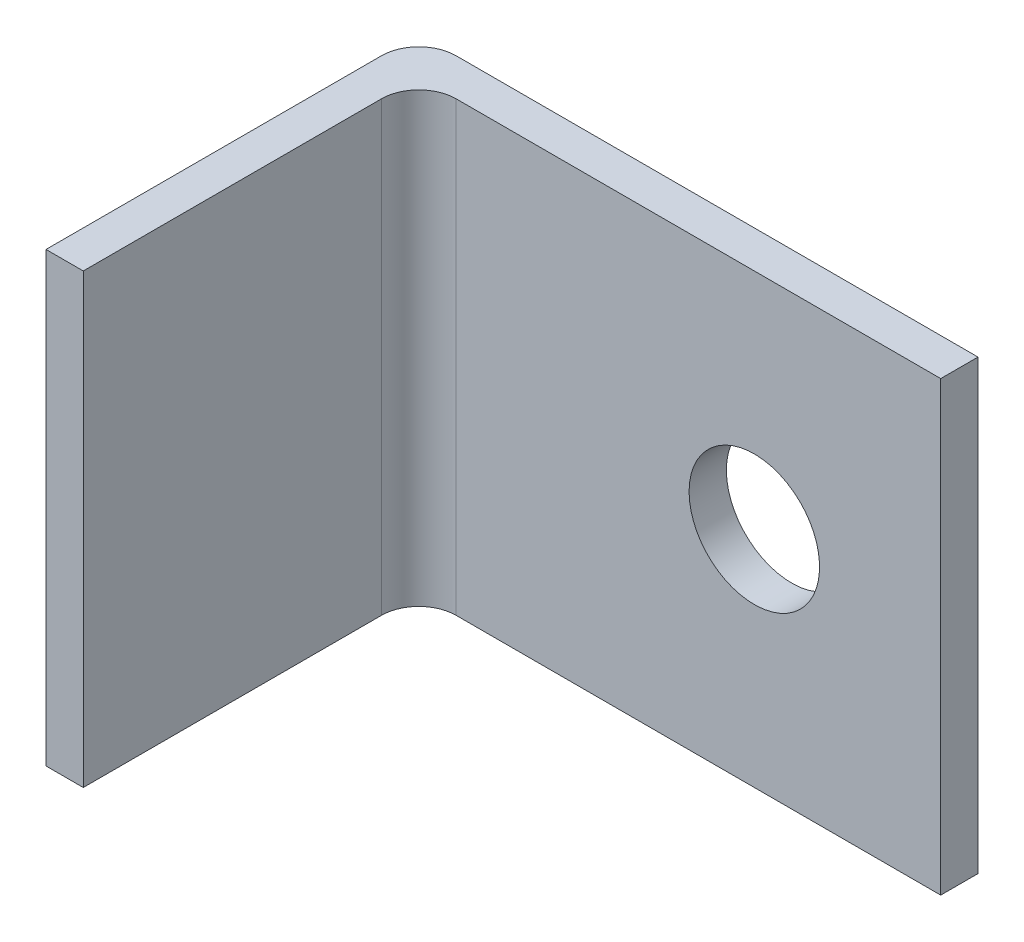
from build123d import *

# Parameters (mm, degrees)
EXTRUDE1_DEPTH     = 12
SKETCH2_R          = 1.75
CUT_EXTRUDE1_DEPTH = 12
FILLET1_R          = 1
FILLET2_R          = 1


with BuildPart() as part:
    # Sketch1 → Extrude1 (new body)
    with BuildSketch(Plane(origin=(0, 0, 0), x_dir=(1, 0, 0), z_dir=(0, 1, 0))):
        Polygon((0, 0), (0, 10), (15, 10), (15, 9), (1, 9), (1, 0), align=None)
    extrude(amount=EXTRUDE1_DEPTH)

    # Sketch2 → Cut-Extrude1 (cut)
    with BuildSketch(Plane(origin=(0, 0, -10), x_dir=(-1, 0, 0), z_dir=(0, 0, -1))):
        with Locations((-10, 6)):
            Circle(SKETCH2_R)
    extrude(amount=-CUT_EXTRUDE1_DEPTH, mode=Mode.SUBTRACT)

    # Fillet1
    fillet1_edges = [part.edges().sort_by_distance(p)[0] for p in [
        (0, 6, -10),
    ]]
    fillet(fillet1_edges, radius=FILLET1_R)

    # Fillet2
    fillet2_edges = [part.edges().sort_by_distance(p)[0] for p in [
        (1, 6, -9),
    ]]
    fillet(fillet2_edges, radius=FILLET2_R)


solid = part.part
